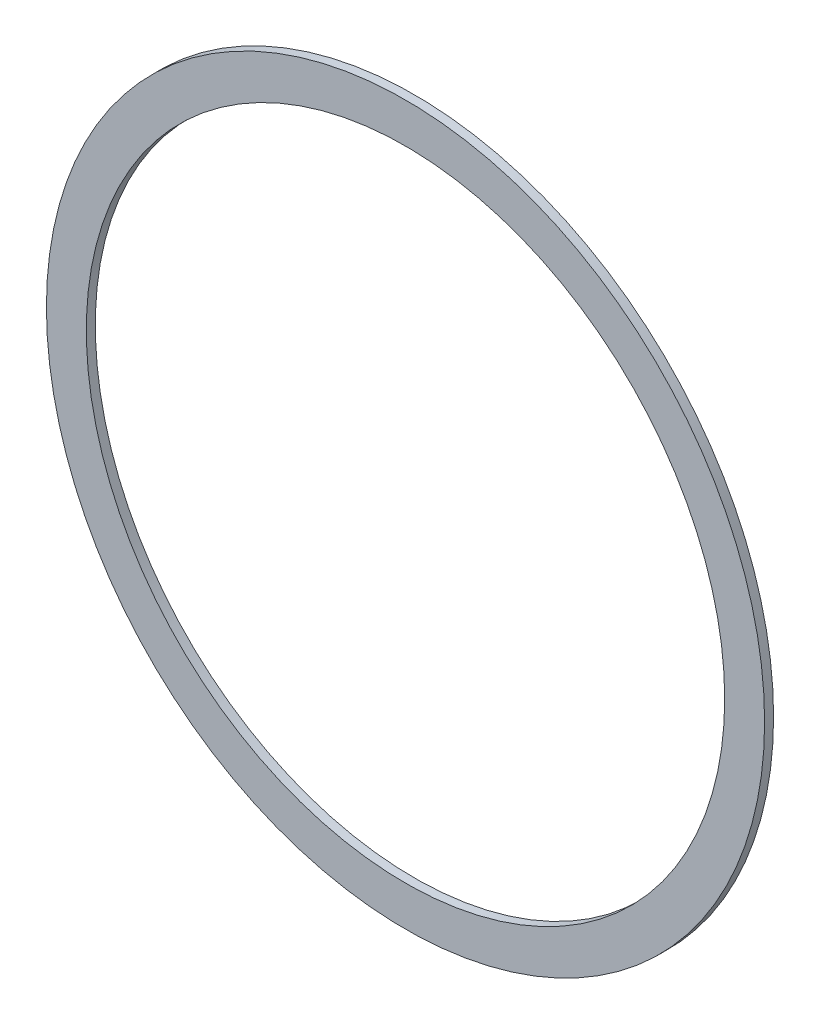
ISO-10303-21;
HEADER;
FILE_DESCRIPTION(('STEP AP214'),'2;1');
FILE_NAME('part.step','',(''),(''),'','','');
FILE_SCHEMA(('AUTOMOTIVE_DESIGN { 1 0 10303 214 1 1 1 1 }'));
ENDSEC;
DATA;
#1=APPLICATION_CONTEXT('core data for automotive mechanical design processes');
#2=APPLICATION_PROTOCOL_DEFINITION('international standard','automotive_design',2000,#1);
#3=PRODUCT_CONTEXT('',#1,'mechanical');
#4=PRODUCT('Part','Part','',(#3));
#5=PRODUCT_RELATED_PRODUCT_CATEGORY('part','',(#4));
#6=PRODUCT_DEFINITION_FORMATION('','',#4);
#7=PRODUCT_DEFINITION_CONTEXT('part definition',#1,'design');
#8=PRODUCT_DEFINITION('design','',#6,#7);
#9=PRODUCT_DEFINITION_SHAPE('','',#8);
#10=(LENGTH_UNIT() NAMED_UNIT(*) SI_UNIT(.MILLI.,.METRE.));
#11=(NAMED_UNIT(*) PLANE_ANGLE_UNIT() SI_UNIT($,.RADIAN.));
#12=(NAMED_UNIT(*) SI_UNIT($,.STERADIAN.) SOLID_ANGLE_UNIT());
#13=UNCERTAINTY_MEASURE_WITH_UNIT(LENGTH_MEASURE(1.E-05),#10,'distance_accuracy_value','');
#14=(GEOMETRIC_REPRESENTATION_CONTEXT(3) GLOBAL_UNCERTAINTY_ASSIGNED_CONTEXT((#13)) GLOBAL_UNIT_ASSIGNED_CONTEXT((#10,
#11,#12)) REPRESENTATION_CONTEXT('',''));
#15=CARTESIAN_POINT('',(0.,0.,0.));
#16=DIRECTION('',(0.,0.,1.));
#17=DIRECTION('',(1.,0.,0.));
#18=AXIS2_PLACEMENT_3D('',#15,#16,#17);
#19=CARTESIAN_POINT('',(0.,0.,11.43));
#20=DIRECTION('',(0.,0.,-1.));
#21=DIRECTION('',(-1.,0.,0.));
#22=AXIS2_PLACEMENT_3D('',#19,#20,#21);
#23=CYLINDRICAL_SURFACE('',#22,457.2);
#24=CARTESIAN_POINT('',(0.,0.,11.43));
#25=DIRECTION('',(0.,0.,1.));
#26=DIRECTION('',(1.,0.,0.));
#27=AXIS2_PLACEMENT_3D('',#24,#25,#26);
#28=CIRCLE('',#27,457.2);
#29=CARTESIAN_POINT('',(457.2,0.,11.43));
#30=VERTEX_POINT('',#29);
#31=EDGE_CURVE('E10',#30,#30,#28,.T.);
#32=ORIENTED_EDGE('',*,*,#31,.F.);
#33=EDGE_LOOP('',(#32));
#34=FACE_BOUND('',#33,.T.);
#35=CARTESIAN_POINT('',(0.,0.,0.));
#36=DIRECTION('',(0.,0.,1.));
#37=DIRECTION('',(1.,0.,0.));
#38=AXIS2_PLACEMENT_3D('',#35,#36,#37);
#39=CIRCLE('',#38,457.2);
#40=CARTESIAN_POINT('',(457.2,0.,0.));
#41=VERTEX_POINT('',#40);
#42=EDGE_CURVE('E39',#41,#41,#39,.T.);
#43=ORIENTED_EDGE('',*,*,#42,.T.);
#44=EDGE_LOOP('',(#43));
#45=FACE_BOUND('',#44,.T.);
#46=ADVANCED_FACE('F33',(#34,#45),#23,.T.);
#47=CARTESIAN_POINT('',(0.,0.,11.43));
#48=DIRECTION('',(0.,0.,1.));
#49=DIRECTION('',(1.,0.,0.));
#50=AXIS2_PLACEMENT_3D('',#47,#48,#49);
#51=PLANE('',#50);
#52=CARTESIAN_POINT('',(0.,0.,11.43));
#53=DIRECTION('',(0.,0.,1.));
#54=DIRECTION('',(1.,0.,0.));
#55=AXIS2_PLACEMENT_3D('',#52,#53,#54);
#56=CIRCLE('',#55,406.4);
#57=CARTESIAN_POINT('',(406.4,0.,11.43));
#58=VERTEX_POINT('',#57);
#59=EDGE_CURVE('E47',#58,#58,#56,.T.);
#60=ORIENTED_EDGE('',*,*,#59,.F.);
#61=EDGE_LOOP('',(#60));
#62=FACE_BOUND('',#61,.T.);
#63=ORIENTED_EDGE('',*,*,#31,.T.);
#64=EDGE_LOOP('',(#63));
#65=FACE_BOUND('',#64,.T.);
#66=ADVANCED_FACE('F55',(#62,#65),#51,.T.);
#67=CARTESIAN_POINT('',(0.,0.,0.));
#68=DIRECTION('',(0.,0.,1.));
#69=DIRECTION('',(1.,0.,0.));
#70=AXIS2_PLACEMENT_3D('',#67,#68,#69);
#71=PLANE('',#70);
#72=CARTESIAN_POINT('',(0.,0.,0.));
#73=DIRECTION('',(0.,0.,1.));
#74=DIRECTION('',(1.,0.,0.));
#75=AXIS2_PLACEMENT_3D('',#72,#73,#74);
#76=CIRCLE('',#75,406.4);
#77=CARTESIAN_POINT('',(406.4,0.,0.));
#78=VERTEX_POINT('',#77);
#79=EDGE_CURVE('E43',#78,#78,#76,.T.);
#80=ORIENTED_EDGE('',*,*,#79,.T.);
#81=EDGE_LOOP('',(#80));
#82=FACE_BOUND('',#81,.T.);
#83=ORIENTED_EDGE('',*,*,#42,.F.);
#84=EDGE_LOOP('',(#83));
#85=FACE_BOUND('',#84,.T.);
#86=ADVANCED_FACE('F57',(#82,#85),#71,.F.);
#87=CARTESIAN_POINT('',(0.,0.,0.));
#88=DIRECTION('',(0.,0.,1.));
#89=DIRECTION('',(1.,0.,0.));
#90=AXIS2_PLACEMENT_3D('',#87,#88,#89);
#91=CYLINDRICAL_SURFACE('',#90,406.4);
#92=ORIENTED_EDGE('',*,*,#79,.F.);
#93=EDGE_LOOP('',(#92));
#94=FACE_BOUND('',#93,.T.);
#95=ORIENTED_EDGE('',*,*,#59,.T.);
#96=EDGE_LOOP('',(#95));
#97=FACE_BOUND('',#96,.T.);
#98=ADVANCED_FACE('F53',(#94,#97),#91,.F.);
#99=CLOSED_SHELL('',(#46,#66,#86,#98));
#100=MANIFOLD_SOLID_BREP('B2',#99);
#101=ADVANCED_BREP_SHAPE_REPRESENTATION('',(#18,#100),#14);
#102=SHAPE_DEFINITION_REPRESENTATION(#9,#101);
ENDSEC;
END-ISO-10303-21;
